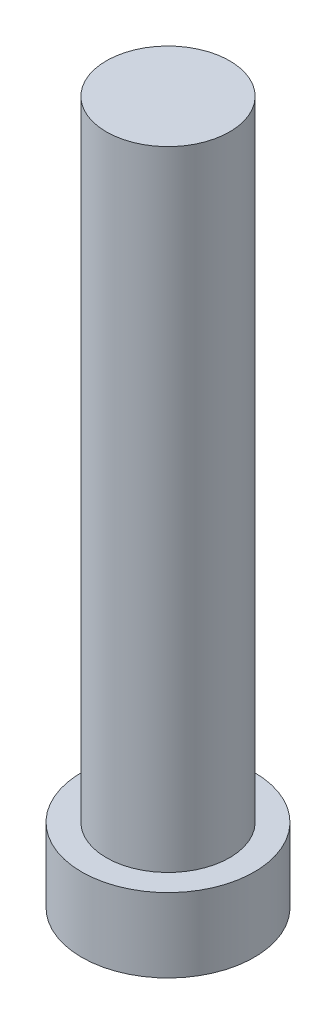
from build123d import *

# Parameters (mm, degrees)
ESQUISSE2_R             = 5
ENL_V_MAT_EXTRU_1_DEPTH = 5


with BuildPart() as part:
    # Esquisse1 → Base-R_volution (revolve)
    with BuildSketch(Plane.XY, mode=Mode.PRIVATE) as base_r_volution_sk:
        Polygon((0, 0), (-7, 0), (-7, 6), (-5, 6), (-5, 62), (0, 62), align=None)
    revolve(base_r_volution_sk.sketch.rotate(Axis((0, 49.432307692, 0), (0, -1, 0)), 270), axis=Axis((0, 49.432307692, 0), (0, -1, 0)))

    # Esquisse2 → Enl_v. mat.-Extru.1 (cut)
    with BuildSketch(Plane(origin=(0, 62, 0), x_dir=(1, 0, 0), z_dir=(0, 1, 0))):
        with Locations(Location((0, 0, 0), (0, 0, 270))):
            Circle(ESQUISSE2_R)
    extrude(amount=-ENL_V_MAT_EXTRU_1_DEPTH, mode=Mode.SUBTRACT)


solid = part.part
